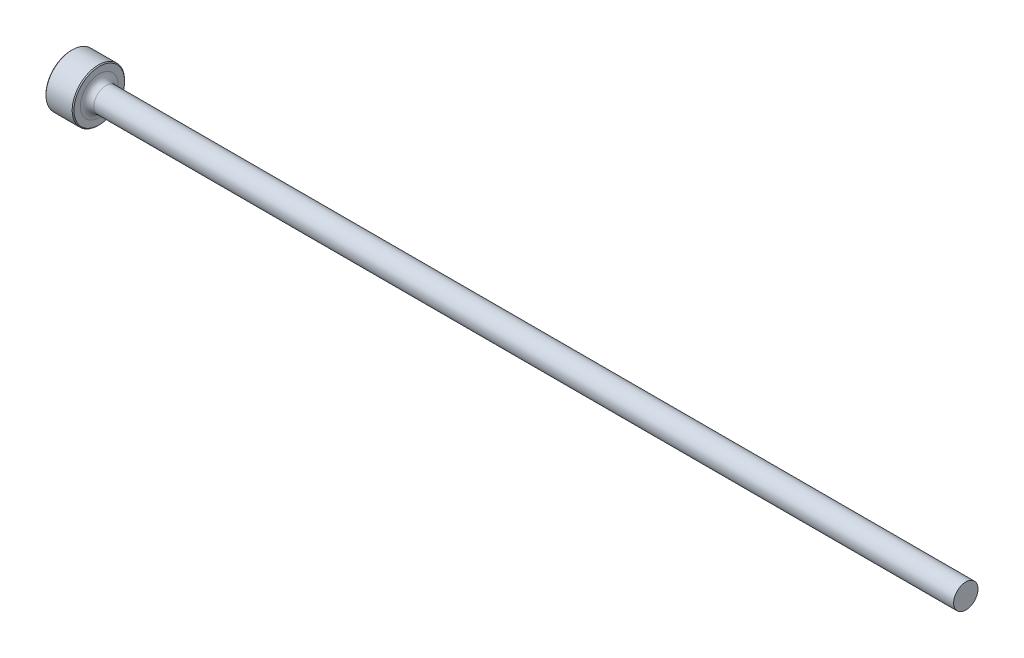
from build123d import *

# Parameters (mm, degrees)
CHAMFER1_SIZE = 0.1016


with BuildPart() as part:
    # Sketch1 → Revolve1 (revolve)
    with BuildSketch(Plane.XY):
        with BuildLine():
            Line((0, 0), (0, 2.9765625))
            Line((0, 2.9765625), (3.175, 2.9765625))
            Line((3.175, 2.9765625), (3.175, 2.1472525))
            ThreePointArc((3.175, 2.1472525), (3.398184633, 1.608437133), (3.937, 1.3852525))
            Line((3.937, 1.3852525), (101.6, 1.3852525))
            Line((101.6, 1.3852525), (101.6, 0))
            Line((101.6, 0), (0, 0))
        make_face()
    revolve(axis=Axis((101.6, 0, 0), (-1, 0, 0)))

    # Chamfer1
    chamfer1_edges = [part.edges().sort_by_distance(p)[0] for p in [
        (0, -2.9765625, 0),
        (3.175, -2.9765625, 0),
    ]]
    chamfer(chamfer1_edges, length=CHAMFER1_SIZE)


solid = part.part
